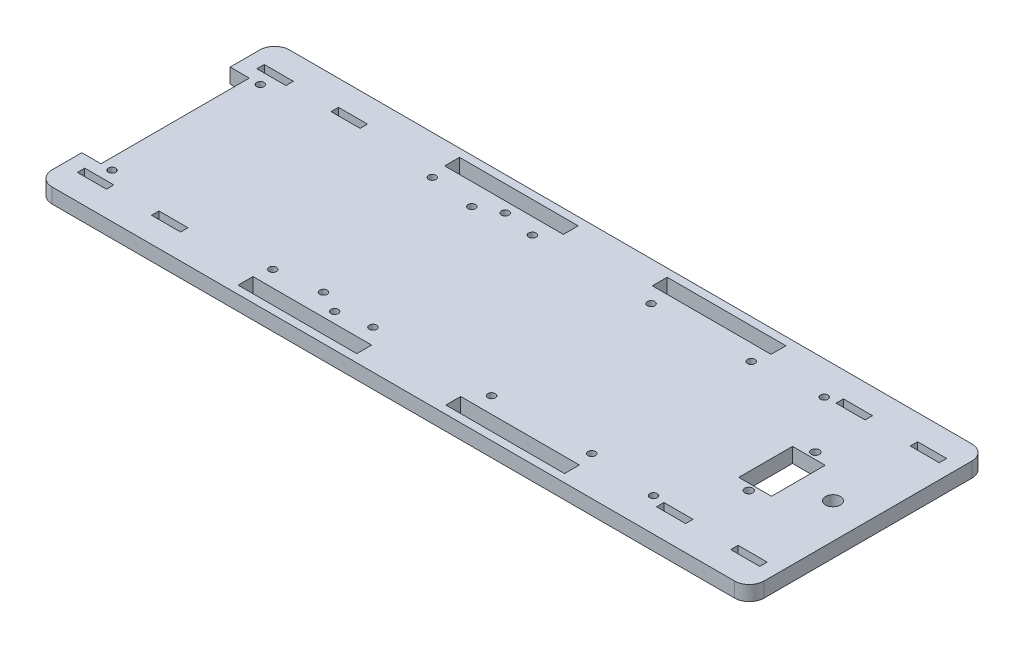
from build123d import *

# Parameters (mm, degrees)
SKETCH1_R      = 1.5875
SKETCH1_R_2    = 3.175
SKETCH1_R_3    = 1.75
SKETCH1_W      = 50.8
SKETCH1_H      = 6.35
SKETCH1_W_2    = 14
SKETCH1_H_2    = 23
SKETCH1_W_3    = 12.446
SKETCH1_H_3    = 3.175
EXTRUDE1_DEPTH = 6.35


with BuildPart() as part:
    # Sketch1 → Extrude1 (new body)
    with BuildSketch(Plane(origin=(0, 0, 0), x_dir=(1, 0, 0), z_dir=(0, 1, 0))):
        with BuildLine():
            Line((-146.05, 0), (146.05, 0))
            ThreePointArc((146.05, 0), (150.540128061, 1.859871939), (152.4, 6.35))
            Line((152.4, 6.35), (152.4, 95.25))
            ThreePointArc((152.4, 95.25), (150.540128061, 99.740128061), (146.05, 101.6))
            Line((146.05, 101.6), (-146.05, 101.6))
            ThreePointArc((-146.05, 101.6), (-150.540128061, 99.740128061), (-152.4, 95.25))
            Line((-152.4, 95.25), (-152.4, 82.55))
            Line((-152.4, 82.55), (-144.2085, 82.55))
            Line((-144.2085, 82.55), (-144.2085, 19.05))
            Line((-144.2085, 19.05), (-152.4, 19.05))
            Line((-152.4, 19.05), (-152.4, 6.35))
            ThreePointArc((-152.4, 6.35), (-150.540128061, 1.859871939), (-146.05, 0))
        make_face()
        with Locations(Location((-139.446, 19.05, 0), (0, 0, 270))):
            Circle(SKETCH1_R, mode=Mode.SUBTRACT)
        with Locations(Location((-39.4335, 14.2875, 0), (0, 0, 270))):
            Circle(SKETCH1_R, mode=Mode.SUBTRACT)
        with Locations(Location((97.0915, 14.2875, 0), (0, 0, 270))):
            Circle(SKETCH1_R, mode=Mode.SUBTRACT)
        with Locations(Location((-39.4335, 87.3125, 0), (0, 0, 270))):
            Circle(SKETCH1_R, mode=Mode.SUBTRACT)
        with Locations(Location((97.0915, 87.3125, 0), (0, 0, 270))):
            Circle(SKETCH1_R, mode=Mode.SUBTRACT)
        with Locations(Location((-48.9585, 19.05, 0), (0, 0, 270))):
            Circle(SKETCH1_R, mode=Mode.SUBTRACT)
        with Locations(Location((-139.446, 82.55, 0), (0, 0, 270))):
            Circle(SKETCH1_R, mode=Mode.SUBTRACT)
        with Locations(Location((-48.9585, 82.55, 0), (0, 0, 270))):
            Circle(SKETCH1_R, mode=Mode.SUBTRACT)
        with Locations(Location((-68.2625, 84.93125, 0), (0, 0, 270))):
            Circle(SKETCH1_R, mode=Mode.SUBTRACT)
        with Locations(Location((-68.2625, 16.66875, 0), (0, 0, 270))):
            Circle(SKETCH1_R, mode=Mode.SUBTRACT)
        with Locations(Location((-25.4, 84.93125, 0), (0, 0, 270))):
            Circle(SKETCH1_R, mode=Mode.SUBTRACT)
        with Locations(Location((-25.4, 16.66875, 0), (0, 0, 270))):
            Circle(SKETCH1_R, mode=Mode.SUBTRACT)
        with Locations(Location((68.2625, 16.66875, 0), (0, 0, 90))):
            Circle(SKETCH1_R, mode=Mode.SUBTRACT)
        with Locations(Location((25.4, 16.66875, 0), (0, 0, 90))):
            Circle(SKETCH1_R, mode=Mode.SUBTRACT)
        with Locations(Location((25.4, 84.93125, 0), (0, 0, 90))):
            Circle(SKETCH1_R, mode=Mode.SUBTRACT)
        with Locations(Location((68.2625, 84.93125, 0), (0, 0, 90))):
            Circle(SKETCH1_R, mode=Mode.SUBTRACT)
        with Locations(Location((137.382106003, 50.8, 0), (0, 0, 270))):
            Circle(SKETCH1_R_2, mode=Mode.SUBTRACT)
        with Locations(Location((115.567271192, 65.05, 0), (0, 0, 270))):
            Circle(SKETCH1_R_3, mode=Mode.SUBTRACT)
        with Locations(Location((115.567271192, 36.55, 0), (0, 0, 90))):
            Circle(SKETCH1_R_3, mode=Mode.SUBTRACT)
        with Locations((-44.45, 6.604)):
            Rectangle(SKETCH1_W, SKETCH1_H, mode=Mode.SUBTRACT)
        with Locations((115.567271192, 50.8)):
            Rectangle(SKETCH1_W_2, SKETCH1_H_2, mode=Mode.SUBTRACT)
        with Locations((-44.45, 94.996)):
            Rectangle(SKETCH1_W, SKETCH1_H, mode=Mode.SUBTRACT)
        with Locations((44.45, 94.996)):
            Rectangle(SKETCH1_W, SKETCH1_H, mode=Mode.SUBTRACT)
        with Locations((44.45, 6.604)):
            Rectangle(SKETCH1_W, SKETCH1_H, mode=Mode.SUBTRACT)
        with Locations((-139.827, 89.2175)):
            Rectangle(SKETCH1_W_3, SKETCH1_H_3, mode=Mode.SUBTRACT)
        with Locations((-108.077, 89.2175)):
            Rectangle(SKETCH1_W_3, SKETCH1_H_3, mode=Mode.SUBTRACT)
        with Locations((-108.077, 12.3825)):
            Rectangle(SKETCH1_W_3, SKETCH1_H_3, mode=Mode.SUBTRACT)
        with Locations((-139.827, 12.3825)):
            Rectangle(SKETCH1_W_3, SKETCH1_H_3, mode=Mode.SUBTRACT)
        with Locations((108.077, 89.2175)):
            Rectangle(SKETCH1_W_3, SKETCH1_H_3, mode=Mode.SUBTRACT)
        with Locations((139.827, 89.2175)):
            Rectangle(SKETCH1_W_3, SKETCH1_H_3, mode=Mode.SUBTRACT)
        with Locations((108.077, 12.3825)):
            Rectangle(SKETCH1_W_3, SKETCH1_H_3, mode=Mode.SUBTRACT)
        with Locations((139.827, 12.3825)):
            Rectangle(SKETCH1_W_3, SKETCH1_H_3, mode=Mode.SUBTRACT)
    extrude(amount=EXTRUDE1_DEPTH)


solid = part.part
